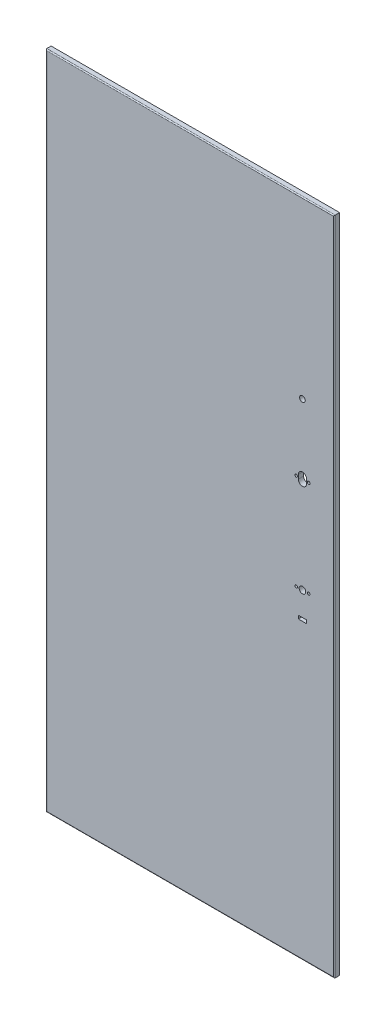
ISO-10303-21;
HEADER;
FILE_DESCRIPTION(('STEP AP214'),'2;1');
FILE_NAME('part.step','',(''),(''),'','','');
FILE_SCHEMA(('AUTOMOTIVE_DESIGN { 1 0 10303 214 1 1 1 1 }'));
ENDSEC;
DATA;
#1=APPLICATION_CONTEXT('core data for automotive mechanical design processes');
#2=APPLICATION_PROTOCOL_DEFINITION('international standard','automotive_design',2000,#1);
#3=PRODUCT_CONTEXT('',#1,'mechanical');
#4=PRODUCT('Part','Part','',(#3));
#5=PRODUCT_RELATED_PRODUCT_CATEGORY('part','',(#4));
#6=PRODUCT_DEFINITION_FORMATION('','',#4);
#7=PRODUCT_DEFINITION_CONTEXT('part definition',#1,'design');
#8=PRODUCT_DEFINITION('design','',#6,#7);
#9=PRODUCT_DEFINITION_SHAPE('','',#8);
#10=(LENGTH_UNIT() NAMED_UNIT(*) SI_UNIT(.MILLI.,.METRE.));
#11=(NAMED_UNIT(*) PLANE_ANGLE_UNIT() SI_UNIT($,.RADIAN.));
#12=(NAMED_UNIT(*) SI_UNIT($,.STERADIAN.) SOLID_ANGLE_UNIT());
#13=UNCERTAINTY_MEASURE_WITH_UNIT(LENGTH_MEASURE(1.E-05),#10,'distance_accuracy_value','');
#14=(GEOMETRIC_REPRESENTATION_CONTEXT(3) GLOBAL_UNCERTAINTY_ASSIGNED_CONTEXT((#13)) GLOBAL_UNIT_ASSIGNED_CONTEXT((#10,
#11,#12)) REPRESENTATION_CONTEXT('',''));
#15=CARTESIAN_POINT('',(0.,0.,0.));
#16=DIRECTION('',(0.,0.,1.));
#17=DIRECTION('',(1.,0.,0.));
#18=AXIS2_PLACEMENT_3D('',#15,#16,#17);
#19=CARTESIAN_POINT('',(-436.,-998.499999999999,16.));
#20=DIRECTION('',(1.,0.,0.));
#21=DIRECTION('',(0.,0.,-1.));
#22=AXIS2_PLACEMENT_3D('',#19,#20,#21);
#23=PLANE('',#22);
#24=DIRECTION('',(0.,0.,-1.));
#25=VECTOR('',#24,1.);
#26=CARTESIAN_POINT('',(-436.,-998.499999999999,16.));
#27=LINE('',#26,#25);
#28=CARTESIAN_POINT('',(-436.,-998.499999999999,13.));
#29=VERTEX_POINT('',#28);
#30=CARTESIAN_POINT('',(-436.,-998.499999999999,0.));
#31=VERTEX_POINT('',#30);
#32=EDGE_CURVE('E270',#29,#31,#27,.T.);
#33=ORIENTED_EDGE('',*,*,#32,.F.);
#34=DIRECTION('',(0.,-1.,0.));
#35=VECTOR('',#34,1.);
#36=CARTESIAN_POINT('',(-436.,-998.499999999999,13.));
#37=LINE('',#36,#35);
#38=CARTESIAN_POINT('',(-436.,998.5,13.));
#39=VERTEX_POINT('',#38);
#40=EDGE_CURVE('E11',#29,#39,#37,.F.);
#41=ORIENTED_EDGE('',*,*,#40,.T.);
#42=DIRECTION('',(0.,0.,-1.));
#43=VECTOR('',#42,1.);
#44=CARTESIAN_POINT('',(-436.,998.5,16.));
#45=LINE('',#44,#43);
#46=CARTESIAN_POINT('',(-436.,998.5,0.));
#47=VERTEX_POINT('',#46);
#48=EDGE_CURVE('E264',#39,#47,#45,.T.);
#49=ORIENTED_EDGE('',*,*,#48,.T.);
#50=DIRECTION('',(0.,-1.,0.));
#51=VECTOR('',#50,1.);
#52=CARTESIAN_POINT('',(-436.,-998.499999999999,0.));
#53=LINE('',#52,#51);
#54=EDGE_CURVE('E161',#47,#31,#53,.T.);
#55=ORIENTED_EDGE('',*,*,#54,.T.);
#56=EDGE_LOOP('',(#33,#41,#49,#55));
#57=FACE_BOUND('',#56,.T.);
#58=ADVANCED_FACE('F41',(#57),#23,.F.);
#59=CARTESIAN_POINT('',(-436.,-998.499999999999,16.));
#60=DIRECTION('',(0.,1.,0.));
#61=DIRECTION('',(0.,0.,1.));
#62=AXIS2_PLACEMENT_3D('',#59,#60,#61);
#63=PLANE('',#62);
#64=DIRECTION('',(0.,0.,-1.));
#65=VECTOR('',#64,1.);
#66=CARTESIAN_POINT('',(436.,-998.499999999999,16.));
#67=LINE('',#66,#65);
#68=CARTESIAN_POINT('',(436.,-998.499999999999,13.));
#69=VERTEX_POINT('',#68);
#70=CARTESIAN_POINT('',(436.,-998.499999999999,0.));
#71=VERTEX_POINT('',#70);
#72=EDGE_CURVE('E268',#69,#71,#67,.T.);
#73=ORIENTED_EDGE('',*,*,#72,.F.);
#74=DIRECTION('',(1.,0.,0.));
#75=VECTOR('',#74,1.);
#76=CARTESIAN_POINT('',(-436.,-998.499999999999,13.));
#77=LINE('',#76,#75);
#78=EDGE_CURVE('E281',#69,#29,#77,.F.);
#79=ORIENTED_EDGE('',*,*,#78,.T.);
#80=ORIENTED_EDGE('',*,*,#32,.T.);
#81=DIRECTION('',(1.,0.,0.));
#82=VECTOR('',#81,1.);
#83=CARTESIAN_POINT('',(-436.,-998.499999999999,0.));
#84=LINE('',#83,#82);
#85=EDGE_CURVE('E255',#31,#71,#84,.T.);
#86=ORIENTED_EDGE('',*,*,#85,.T.);
#87=EDGE_LOOP('',(#73,#79,#80,#86));
#88=FACE_BOUND('',#87,.T.);
#89=ADVANCED_FACE('F311',(#88),#63,.F.);
#90=CARTESIAN_POINT('',(436.,-998.499999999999,16.));
#91=DIRECTION('',(-1.,0.,0.));
#92=DIRECTION('',(0.,0.,1.));
#93=AXIS2_PLACEMENT_3D('',#90,#91,#92);
#94=PLANE('',#93);
#95=DIRECTION('',(0.,0.,-1.));
#96=VECTOR('',#95,1.);
#97=CARTESIAN_POINT('',(436.,998.5,16.));
#98=LINE('',#97,#96);
#99=CARTESIAN_POINT('',(436.,998.5,13.));
#100=VERTEX_POINT('',#99);
#101=CARTESIAN_POINT('',(436.,998.5,0.));
#102=VERTEX_POINT('',#101);
#103=EDGE_CURVE('E266',#100,#102,#98,.T.);
#104=ORIENTED_EDGE('',*,*,#103,.F.);
#105=DIRECTION('',(0.,1.,0.));
#106=VECTOR('',#105,1.);
#107=CARTESIAN_POINT('',(436.,-998.499999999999,13.));
#108=LINE('',#107,#106);
#109=EDGE_CURVE('E284',#100,#69,#108,.F.);
#110=ORIENTED_EDGE('',*,*,#109,.T.);
#111=ORIENTED_EDGE('',*,*,#72,.T.);
#112=DIRECTION('',(0.,1.,0.));
#113=VECTOR('',#112,1.);
#114=CARTESIAN_POINT('',(436.,-998.499999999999,0.));
#115=LINE('',#114,#113);
#116=EDGE_CURVE('E258',#71,#102,#115,.T.);
#117=ORIENTED_EDGE('',*,*,#116,.T.);
#118=EDGE_LOOP('',(#104,#110,#111,#117));
#119=FACE_BOUND('',#118,.T.);
#120=ADVANCED_FACE('F308',(#119),#94,.F.);
#121=CARTESIAN_POINT('',(-436.,998.5,16.));
#122=DIRECTION('',(0.,-1.,0.));
#123=DIRECTION('',(0.,0.,-1.));
#124=AXIS2_PLACEMENT_3D('',#121,#122,#123);
#125=PLANE('',#124);
#126=ORIENTED_EDGE('',*,*,#48,.F.);
#127=DIRECTION('',(-1.,0.,0.));
#128=VECTOR('',#127,1.);
#129=CARTESIAN_POINT('',(-436.,998.5,13.));
#130=LINE('',#129,#128);
#131=EDGE_CURVE('E50',#39,#100,#130,.F.);
#132=ORIENTED_EDGE('',*,*,#131,.T.);
#133=ORIENTED_EDGE('',*,*,#103,.T.);
#134=DIRECTION('',(-1.,0.,0.));
#135=VECTOR('',#134,1.);
#136=CARTESIAN_POINT('',(-436.,998.5,0.));
#137=LINE('',#136,#135);
#138=EDGE_CURVE('E261',#102,#47,#137,.T.);
#139=ORIENTED_EDGE('',*,*,#138,.T.);
#140=EDGE_LOOP('',(#126,#132,#133,#139));
#141=FACE_BOUND('',#140,.T.);
#142=ADVANCED_FACE('F320',(#141),#125,.F.);
#143=CARTESIAN_POINT('',(0.,0.,16.));
#144=DIRECTION('',(0.,0.,-1.));
#145=DIRECTION('',(-1.,0.,0.));
#146=AXIS2_PLACEMENT_3D('',#143,#144,#145);
#147=PLANE('',#146);
#148=DIRECTION('',(0.,-1.,0.));
#149=VECTOR('',#148,1.);
#150=CARTESIAN_POINT('',(-433.,0.,16.));
#151=LINE('',#150,#149);
#152=CARTESIAN_POINT('',(-433.,995.5,16.));
#153=VERTEX_POINT('',#152);
#154=CARTESIAN_POINT('',(-433.,-995.499999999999,16.));
#155=VERTEX_POINT('',#154);
#156=EDGE_CURVE('E272',#153,#155,#151,.T.);
#157=ORIENTED_EDGE('',*,*,#156,.T.);
#158=DIRECTION('',(1.,0.,0.));
#159=VECTOR('',#158,1.);
#160=CARTESIAN_POINT('',(0.,-995.499999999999,16.));
#161=LINE('',#160,#159);
#162=CARTESIAN_POINT('',(433.,-995.499999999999,16.));
#163=VERTEX_POINT('',#162);
#164=EDGE_CURVE('E278',#155,#163,#161,.T.);
#165=ORIENTED_EDGE('',*,*,#164,.T.);
#166=DIRECTION('',(0.,1.,0.));
#167=VECTOR('',#166,1.);
#168=CARTESIAN_POINT('',(433.,0.,16.));
#169=LINE('',#168,#167);
#170=CARTESIAN_POINT('',(433.,995.5,16.));
#171=VERTEX_POINT('',#170);
#172=EDGE_CURVE('E276',#163,#171,#169,.T.);
#173=ORIENTED_EDGE('',*,*,#172,.T.);
#174=DIRECTION('',(-1.,0.,0.));
#175=VECTOR('',#174,1.);
#176=CARTESIAN_POINT('',(0.,995.5,16.));
#177=LINE('',#176,#175);
#178=EDGE_CURVE('E274',#171,#153,#177,.T.);
#179=ORIENTED_EDGE('',*,*,#178,.T.);
#180=EDGE_LOOP('',(#157,#165,#173,#179));
#181=FACE_BOUND('',#180,.T.);
#182=DIRECTION('',(0.,-1.,0.));
#183=VECTOR('',#182,1.);
#184=CARTESIAN_POINT('',(327.199999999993,-101.800000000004,16.));
#185=LINE('',#184,#183);
#186=CARTESIAN_POINT('',(327.199999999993,-101.800000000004,16.));
#187=VERTEX_POINT('',#186);
#188=CARTESIAN_POINT('',(327.199999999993,-111.800000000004,16.));
#189=VERTEX_POINT('',#188);
#190=EDGE_CURVE('E143',#187,#189,#185,.T.);
#191=ORIENTED_EDGE('',*,*,#190,.F.);
#192=DIRECTION('',(-1.,0.,0.));
#193=VECTOR('',#192,1.);
#194=CARTESIAN_POINT('',(352.199999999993,-101.800000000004,16.));
#195=LINE('',#194,#193);
#196=CARTESIAN_POINT('',(352.199999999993,-101.800000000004,16.));
#197=VERTEX_POINT('',#196);
#198=EDGE_CURVE('E170',#197,#187,#195,.T.);
#199=ORIENTED_EDGE('',*,*,#198,.F.);
#200=DIRECTION('',(0.,1.,0.));
#201=VECTOR('',#200,1.);
#202=CARTESIAN_POINT('',(352.199999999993,-111.800000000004,16.));
#203=LINE('',#202,#201);
#204=CARTESIAN_POINT('',(352.199999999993,-111.800000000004,16.));
#205=VERTEX_POINT('',#204);
#206=EDGE_CURVE('E168',#205,#197,#203,.T.);
#207=ORIENTED_EDGE('',*,*,#206,.F.);
#208=DIRECTION('',(1.,0.,0.));
#209=VECTOR('',#208,1.);
#210=CARTESIAN_POINT('',(327.199999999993,-111.800000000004,16.));
#211=LINE('',#210,#209);
#212=EDGE_CURVE('E153',#189,#205,#211,.T.);
#213=ORIENTED_EDGE('',*,*,#212,.F.);
#214=EDGE_LOOP('',(#191,#199,#207,#213));
#215=FACE_BOUND('',#214,.T.);
#216=CARTESIAN_POINT('',(320.699999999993,260.399999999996,16.));
#217=DIRECTION('',(0.,0.,1.));
#218=DIRECTION('',(1.,0.,0.));
#219=AXIS2_PLACEMENT_3D('',#216,#217,#218);
#220=CIRCLE('',#219,4.09999999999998);
#221=CARTESIAN_POINT('',(324.799999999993,260.399999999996,16.));
#222=VERTEX_POINT('',#221);
#223=EDGE_CURVE('E200',#222,#222,#220,.T.);
#224=ORIENTED_EDGE('',*,*,#223,.F.);
#225=EDGE_LOOP('',(#224));
#226=FACE_BOUND('',#225,.T.);
#227=CARTESIAN_POINT('',(358.699999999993,260.399999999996,16.));
#228=DIRECTION('',(0.,0.,1.));
#229=DIRECTION('',(1.,0.,0.));
#230=AXIS2_PLACEMENT_3D('',#227,#228,#229);
#231=CIRCLE('',#230,4.09999999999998);
#232=CARTESIAN_POINT('',(362.799999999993,260.399999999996,16.));
#233=VERTEX_POINT('',#232);
#234=EDGE_CURVE('E194',#233,#233,#231,.T.);
#235=ORIENTED_EDGE('',*,*,#234,.F.);
#236=EDGE_LOOP('',(#235));
#237=FACE_BOUND('',#236,.T.);
#238=CARTESIAN_POINT('',(339.699999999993,470.200000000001,16.));
#239=DIRECTION('',(0.,0.,1.));
#240=DIRECTION('',(1.,0.,0.));
#241=AXIS2_PLACEMENT_3D('',#238,#239,#240);
#242=CIRCLE('',#241,8.50000000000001);
#243=CARTESIAN_POINT('',(348.199999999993,470.200000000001,16.));
#244=VERTEX_POINT('',#243);
#245=EDGE_CURVE('E187',#244,#244,#242,.T.);
#246=ORIENTED_EDGE('',*,*,#245,.F.);
#247=EDGE_LOOP('',(#246));
#248=FACE_BOUND('',#247,.T.);
#249=CARTESIAN_POINT('',(339.699999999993,-29.8000000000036,16.));
#250=DIRECTION('',(0.,0.,1.));
#251=DIRECTION('',(1.,0.,0.));
#252=AXIS2_PLACEMENT_3D('',#249,#250,#251);
#253=CIRCLE('',#252,9.99999999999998);
#254=CARTESIAN_POINT('',(349.699999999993,-29.8000000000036,16.));
#255=VERTEX_POINT('',#254);
#256=EDGE_CURVE('E176',#255,#255,#253,.T.);
#257=ORIENTED_EDGE('',*,*,#256,.F.);
#258=EDGE_LOOP('',(#257));
#259=FACE_BOUND('',#258,.T.);
#260=CARTESIAN_POINT('',(339.699999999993,266.649999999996,16.));
#261=DIRECTION('',(0.,0.,1.));
#262=DIRECTION('',(1.,0.,0.));
#263=AXIS2_PLACEMENT_3D('',#260,#261,#262);
#264=CIRCLE('',#263,12.5);
#265=CARTESIAN_POINT('',(352.199999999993,266.649999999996,16.));
#266=VERTEX_POINT('',#265);
#267=CARTESIAN_POINT('',(327.199999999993,266.649999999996,16.));
#268=VERTEX_POINT('',#267);
#269=EDGE_CURVE('E224',#266,#268,#264,.T.);
#270=ORIENTED_EDGE('',*,*,#269,.F.);
#271=DIRECTION('',(0.,1.,0.));
#272=VECTOR('',#271,1.);
#273=CARTESIAN_POINT('',(352.199999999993,254.149999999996,16.));
#274=LINE('',#273,#272);
#275=CARTESIAN_POINT('',(352.199999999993,254.149999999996,16.));
#276=VERTEX_POINT('',#275);
#277=EDGE_CURVE('E232',#276,#266,#274,.T.);
#278=ORIENTED_EDGE('',*,*,#277,.F.);
#279=CARTESIAN_POINT('',(339.699999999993,254.149999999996,16.));
#280=DIRECTION('',(0.,0.,1.));
#281=DIRECTION('',(1.,0.,0.));
#282=AXIS2_PLACEMENT_3D('',#279,#280,#281);
#283=CIRCLE('',#282,12.5);
#284=CARTESIAN_POINT('',(327.199999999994,254.149999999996,16.));
#285=VERTEX_POINT('',#284);
#286=EDGE_CURVE('E229',#285,#276,#283,.T.);
#287=ORIENTED_EDGE('',*,*,#286,.F.);
#288=DIRECTION('',(0.,-1.,0.));
#289=VECTOR('',#288,1.);
#290=CARTESIAN_POINT('',(327.199999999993,266.649999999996,16.));
#291=LINE('',#290,#289);
#292=EDGE_CURVE('E226',#268,#285,#291,.T.);
#293=ORIENTED_EDGE('',*,*,#292,.F.);
#294=EDGE_LOOP('',(#270,#278,#287,#293));
#295=FACE_BOUND('',#294,.T.);
#296=CARTESIAN_POINT('',(358.699999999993,-29.8000000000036,16.));
#297=DIRECTION('',(0.,0.,1.));
#298=DIRECTION('',(1.,0.,0.));
#299=AXIS2_PLACEMENT_3D('',#296,#297,#298);
#300=CIRCLE('',#299,3.99999999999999);
#301=CARTESIAN_POINT('',(362.699999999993,-29.8000000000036,16.));
#302=VERTEX_POINT('',#301);
#303=EDGE_CURVE('E206',#302,#302,#300,.T.);
#304=ORIENTED_EDGE('',*,*,#303,.F.);
#305=EDGE_LOOP('',(#304));
#306=FACE_BOUND('',#305,.T.);
#307=CARTESIAN_POINT('',(320.699999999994,-29.8000000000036,16.));
#308=DIRECTION('',(0.,0.,1.));
#309=DIRECTION('',(1.,0.,0.));
#310=AXIS2_PLACEMENT_3D('',#307,#308,#309);
#311=CIRCLE('',#310,3.99999999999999);
#312=CARTESIAN_POINT('',(324.699999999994,-29.8000000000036,16.));
#313=VERTEX_POINT('',#312);
#314=EDGE_CURVE('E213',#313,#313,#311,.T.);
#315=ORIENTED_EDGE('',*,*,#314,.F.);
#316=EDGE_LOOP('',(#315));
#317=FACE_BOUND('',#316,.T.);
#318=ADVANCED_FACE('F165',(#181,#215,#226,#237,#248,#259,#295,#306,#317),#147,.F.);
#319=CARTESIAN_POINT('',(0.,0.,0.));
#320=DIRECTION('',(0.,0.,-1.));
#321=DIRECTION('',(-1.,0.,0.));
#322=AXIS2_PLACEMENT_3D('',#319,#320,#321);
#323=PLANE('',#322);
#324=DIRECTION('',(-1.,0.,0.));
#325=VECTOR('',#324,1.);
#326=CARTESIAN_POINT('',(352.199999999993,-101.800000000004,0.));
#327=LINE('',#326,#325);
#328=CARTESIAN_POINT('',(352.199999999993,-101.800000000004,0.));
#329=VERTEX_POINT('',#328);
#330=CARTESIAN_POINT('',(327.199999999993,-101.800000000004,0.));
#331=VERTEX_POINT('',#330);
#332=EDGE_CURVE('E154',#329,#331,#327,.T.);
#333=ORIENTED_EDGE('',*,*,#332,.T.);
#334=DIRECTION('',(0.,-1.,0.));
#335=VECTOR('',#334,1.);
#336=CARTESIAN_POINT('',(327.199999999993,-101.800000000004,0.));
#337=LINE('',#336,#335);
#338=CARTESIAN_POINT('',(327.199999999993,-111.800000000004,0.));
#339=VERTEX_POINT('',#338);
#340=EDGE_CURVE('E174',#331,#339,#337,.T.);
#341=ORIENTED_EDGE('',*,*,#340,.T.);
#342=DIRECTION('',(1.,0.,0.));
#343=VECTOR('',#342,1.);
#344=CARTESIAN_POINT('',(327.199999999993,-111.800000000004,0.));
#345=LINE('',#344,#343);
#346=CARTESIAN_POINT('',(352.199999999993,-111.800000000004,0.));
#347=VERTEX_POINT('',#346);
#348=EDGE_CURVE('E160',#339,#347,#345,.T.);
#349=ORIENTED_EDGE('',*,*,#348,.T.);
#350=DIRECTION('',(0.,1.,0.));
#351=VECTOR('',#350,1.);
#352=CARTESIAN_POINT('',(352.199999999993,-111.800000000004,0.));
#353=LINE('',#352,#351);
#354=EDGE_CURVE('E178',#347,#329,#353,.T.);
#355=ORIENTED_EDGE('',*,*,#354,.T.);
#356=EDGE_LOOP('',(#333,#341,#349,#355));
#357=FACE_BOUND('',#356,.T.);
#358=CARTESIAN_POINT('',(320.699999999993,260.399999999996,0.));
#359=DIRECTION('',(0.,0.,1.));
#360=DIRECTION('',(1.,0.,0.));
#361=AXIS2_PLACEMENT_3D('',#358,#359,#360);
#362=CIRCLE('',#361,4.09999999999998);
#363=CARTESIAN_POINT('',(324.799999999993,260.399999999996,0.));
#364=VERTEX_POINT('',#363);
#365=EDGE_CURVE('E203',#364,#364,#362,.T.);
#366=ORIENTED_EDGE('',*,*,#365,.T.);
#367=EDGE_LOOP('',(#366));
#368=FACE_BOUND('',#367,.T.);
#369=CARTESIAN_POINT('',(358.699999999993,260.399999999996,0.));
#370=DIRECTION('',(0.,0.,1.));
#371=DIRECTION('',(1.,0.,0.));
#372=AXIS2_PLACEMENT_3D('',#369,#370,#371);
#373=CIRCLE('',#372,4.09999999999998);
#374=CARTESIAN_POINT('',(362.799999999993,260.399999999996,0.));
#375=VERTEX_POINT('',#374);
#376=EDGE_CURVE('E197',#375,#375,#373,.T.);
#377=ORIENTED_EDGE('',*,*,#376,.T.);
#378=EDGE_LOOP('',(#377));
#379=FACE_BOUND('',#378,.T.);
#380=CARTESIAN_POINT('',(339.699999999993,470.200000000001,0.));
#381=DIRECTION('',(0.,0.,1.));
#382=DIRECTION('',(1.,0.,0.));
#383=AXIS2_PLACEMENT_3D('',#380,#381,#382);
#384=CIRCLE('',#383,8.50000000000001);
#385=CARTESIAN_POINT('',(348.199999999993,470.200000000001,0.));
#386=VERTEX_POINT('',#385);
#387=EDGE_CURVE('E191',#386,#386,#384,.T.);
#388=ORIENTED_EDGE('',*,*,#387,.T.);
#389=EDGE_LOOP('',(#388));
#390=FACE_BOUND('',#389,.T.);
#391=CARTESIAN_POINT('',(339.699999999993,-29.8000000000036,0.));
#392=DIRECTION('',(0.,0.,1.));
#393=DIRECTION('',(1.,0.,0.));
#394=AXIS2_PLACEMENT_3D('',#391,#392,#393);
#395=CIRCLE('',#394,9.99999999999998);
#396=CARTESIAN_POINT('',(349.699999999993,-29.8000000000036,0.));
#397=VERTEX_POINT('',#396);
#398=EDGE_CURVE('E220',#397,#397,#395,.T.);
#399=ORIENTED_EDGE('',*,*,#398,.T.);
#400=EDGE_LOOP('',(#399));
#401=FACE_BOUND('',#400,.T.);
#402=DIRECTION('',(0.,1.,0.));
#403=VECTOR('',#402,1.);
#404=CARTESIAN_POINT('',(352.199999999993,254.149999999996,0.));
#405=LINE('',#404,#403);
#406=CARTESIAN_POINT('',(352.199999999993,254.149999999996,0.));
#407=VERTEX_POINT('',#406);
#408=CARTESIAN_POINT('',(352.199999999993,266.649999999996,0.));
#409=VERTEX_POINT('',#408);
#410=EDGE_CURVE('E227',#407,#409,#405,.T.);
#411=ORIENTED_EDGE('',*,*,#410,.T.);
#412=CARTESIAN_POINT('',(339.699999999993,266.649999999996,0.));
#413=DIRECTION('',(0.,0.,1.));
#414=DIRECTION('',(1.,0.,0.));
#415=AXIS2_PLACEMENT_3D('',#412,#413,#414);
#416=CIRCLE('',#415,12.5);
#417=CARTESIAN_POINT('',(327.199999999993,266.649999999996,0.));
#418=VERTEX_POINT('',#417);
#419=EDGE_CURVE('E209',#409,#418,#416,.T.);
#420=ORIENTED_EDGE('',*,*,#419,.T.);
#421=DIRECTION('',(0.,-1.,0.));
#422=VECTOR('',#421,1.);
#423=CARTESIAN_POINT('',(327.199999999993,266.649999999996,0.));
#424=LINE('',#423,#422);
#425=CARTESIAN_POINT('',(327.199999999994,254.149999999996,0.));
#426=VERTEX_POINT('',#425);
#427=EDGE_CURVE('E237',#418,#426,#424,.T.);
#428=ORIENTED_EDGE('',*,*,#427,.T.);
#429=CARTESIAN_POINT('',(339.699999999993,254.149999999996,0.));
#430=DIRECTION('',(0.,0.,1.));
#431=DIRECTION('',(1.,0.,0.));
#432=AXIS2_PLACEMENT_3D('',#429,#430,#431);
#433=CIRCLE('',#432,12.5);
#434=EDGE_CURVE('E240',#426,#407,#433,.T.);
#435=ORIENTED_EDGE('',*,*,#434,.T.);
#436=EDGE_LOOP('',(#411,#420,#428,#435));
#437=FACE_BOUND('',#436,.T.);
#438=CARTESIAN_POINT('',(358.699999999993,-29.8000000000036,0.));
#439=DIRECTION('',(0.,0.,1.));
#440=DIRECTION('',(1.,0.,0.));
#441=AXIS2_PLACEMENT_3D('',#438,#439,#440);
#442=CIRCLE('',#441,3.99999999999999);
#443=CARTESIAN_POINT('',(362.699999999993,-29.8000000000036,0.));
#444=VERTEX_POINT('',#443);
#445=EDGE_CURVE('E210',#444,#444,#442,.T.);
#446=ORIENTED_EDGE('',*,*,#445,.T.);
#447=EDGE_LOOP('',(#446));
#448=FACE_BOUND('',#447,.T.);
#449=CARTESIAN_POINT('',(320.699999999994,-29.8000000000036,0.));
#450=DIRECTION('',(0.,0.,1.));
#451=DIRECTION('',(1.,0.,0.));
#452=AXIS2_PLACEMENT_3D('',#449,#450,#451);
#453=CIRCLE('',#452,3.99999999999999);
#454=CARTESIAN_POINT('',(324.699999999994,-29.8000000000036,0.));
#455=VERTEX_POINT('',#454);
#456=EDGE_CURVE('E190',#455,#455,#453,.T.);
#457=ORIENTED_EDGE('',*,*,#456,.T.);
#458=EDGE_LOOP('',(#457));
#459=FACE_BOUND('',#458,.T.);
#460=ORIENTED_EDGE('',*,*,#54,.F.);
#461=ORIENTED_EDGE('',*,*,#138,.F.);
#462=ORIENTED_EDGE('',*,*,#116,.F.);
#463=ORIENTED_EDGE('',*,*,#85,.F.);
#464=EDGE_LOOP('',(#460,#461,#462,#463));
#465=FACE_BOUND('',#464,.T.);
#466=ADVANCED_FACE('F319',(#357,#368,#379,#390,#401,#437,#448,#459,#465),#323,.T.);
#467=CARTESIAN_POINT('',(320.699999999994,-29.8000000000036,16.));
#468=DIRECTION('',(0.,0.,-1.));
#469=DIRECTION('',(-1.,0.,0.));
#470=AXIS2_PLACEMENT_3D('',#467,#468,#469);
#471=CYLINDRICAL_SURFACE('',#470,3.99999999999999);
#472=ORIENTED_EDGE('',*,*,#314,.T.);
#473=EDGE_LOOP('',(#472));
#474=FACE_BOUND('',#473,.T.);
#475=ORIENTED_EDGE('',*,*,#456,.F.);
#476=EDGE_LOOP('',(#475));
#477=FACE_BOUND('',#476,.T.);
#478=ADVANCED_FACE('F326',(#474,#477),#471,.F.);
#479=CARTESIAN_POINT('',(358.699999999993,-29.8000000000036,16.));
#480=DIRECTION('',(0.,0.,-1.));
#481=DIRECTION('',(-1.,0.,0.));
#482=AXIS2_PLACEMENT_3D('',#479,#480,#481);
#483=CYLINDRICAL_SURFACE('',#482,3.99999999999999);
#484=ORIENTED_EDGE('',*,*,#303,.T.);
#485=EDGE_LOOP('',(#484));
#486=FACE_BOUND('',#485,.T.);
#487=ORIENTED_EDGE('',*,*,#445,.F.);
#488=EDGE_LOOP('',(#487));
#489=FACE_BOUND('',#488,.T.);
#490=ADVANCED_FACE('F377',(#486,#489),#483,.F.);
#491=CARTESIAN_POINT('',(339.699999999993,266.649999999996,16.));
#492=DIRECTION('',(0.,0.,-1.));
#493=DIRECTION('',(-1.,0.,0.));
#494=AXIS2_PLACEMENT_3D('',#491,#492,#493);
#495=CYLINDRICAL_SURFACE('',#494,12.5);
#496=ORIENTED_EDGE('',*,*,#419,.F.);
#497=DIRECTION('',(0.,0.,-1.));
#498=VECTOR('',#497,1.);
#499=CARTESIAN_POINT('',(352.199999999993,266.649999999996,16.));
#500=LINE('',#499,#498);
#501=EDGE_CURVE('E234',#266,#409,#500,.T.);
#502=ORIENTED_EDGE('',*,*,#501,.F.);
#503=ORIENTED_EDGE('',*,*,#269,.T.);
#504=DIRECTION('',(0.,0.,-1.));
#505=VECTOR('',#504,1.);
#506=CARTESIAN_POINT('',(327.199999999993,266.649999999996,16.));
#507=LINE('',#506,#505);
#508=EDGE_CURVE('E223',#268,#418,#507,.T.);
#509=ORIENTED_EDGE('',*,*,#508,.T.);
#510=EDGE_LOOP('',(#496,#502,#503,#509));
#511=FACE_BOUND('',#510,.T.);
#512=ADVANCED_FACE('F380',(#511),#495,.F.);
#513=CARTESIAN_POINT('',(327.199999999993,266.649999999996,16.));
#514=DIRECTION('',(1.,0.,0.));
#515=DIRECTION('',(0.,1.,0.));
#516=AXIS2_PLACEMENT_3D('',#513,#514,#515);
#517=PLANE('',#516);
#518=ORIENTED_EDGE('',*,*,#427,.F.);
#519=ORIENTED_EDGE('',*,*,#508,.F.);
#520=ORIENTED_EDGE('',*,*,#292,.T.);
#521=DIRECTION('',(0.,0.,-1.));
#522=VECTOR('',#521,1.);
#523=CARTESIAN_POINT('',(327.199999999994,254.149999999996,16.));
#524=LINE('',#523,#522);
#525=EDGE_CURVE('E249',#285,#426,#524,.T.);
#526=ORIENTED_EDGE('',*,*,#525,.T.);
#527=EDGE_LOOP('',(#518,#519,#520,#526));
#528=FACE_BOUND('',#527,.T.);
#529=ADVANCED_FACE('F395',(#528),#517,.T.);
#530=CARTESIAN_POINT('',(339.699999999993,254.149999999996,16.));
#531=DIRECTION('',(0.,0.,-1.));
#532=DIRECTION('',(-1.,0.,0.));
#533=AXIS2_PLACEMENT_3D('',#530,#531,#532);
#534=CYLINDRICAL_SURFACE('',#533,12.5);
#535=ORIENTED_EDGE('',*,*,#434,.F.);
#536=ORIENTED_EDGE('',*,*,#525,.F.);
#537=ORIENTED_EDGE('',*,*,#286,.T.);
#538=DIRECTION('',(0.,0.,-1.));
#539=VECTOR('',#538,1.);
#540=CARTESIAN_POINT('',(352.199999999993,254.149999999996,16.));
#541=LINE('',#540,#539);
#542=EDGE_CURVE('E247',#276,#407,#541,.T.);
#543=ORIENTED_EDGE('',*,*,#542,.T.);
#544=EDGE_LOOP('',(#535,#536,#537,#543));
#545=FACE_BOUND('',#544,.T.);
#546=ADVANCED_FACE('F391',(#545),#534,.F.);
#547=CARTESIAN_POINT('',(352.199999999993,254.149999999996,16.));
#548=DIRECTION('',(-1.,0.,0.));
#549=DIRECTION('',(0.,0.,1.));
#550=AXIS2_PLACEMENT_3D('',#547,#548,#549);
#551=PLANE('',#550);
#552=ORIENTED_EDGE('',*,*,#410,.F.);
#553=ORIENTED_EDGE('',*,*,#542,.F.);
#554=ORIENTED_EDGE('',*,*,#277,.T.);
#555=ORIENTED_EDGE('',*,*,#501,.T.);
#556=EDGE_LOOP('',(#552,#553,#554,#555));
#557=FACE_BOUND('',#556,.T.);
#558=ADVANCED_FACE('F387',(#557),#551,.T.);
#559=CARTESIAN_POINT('',(339.699999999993,-29.8000000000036,16.));
#560=DIRECTION('',(0.,0.,-1.));
#561=DIRECTION('',(-1.,0.,0.));
#562=AXIS2_PLACEMENT_3D('',#559,#560,#561);
#563=CYLINDRICAL_SURFACE('',#562,9.99999999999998);
#564=ORIENTED_EDGE('',*,*,#256,.T.);
#565=EDGE_LOOP('',(#564));
#566=FACE_BOUND('',#565,.T.);
#567=ORIENTED_EDGE('',*,*,#398,.F.);
#568=EDGE_LOOP('',(#567));
#569=FACE_BOUND('',#568,.T.);
#570=ADVANCED_FACE('F369',(#566,#569),#563,.F.);
#571=CARTESIAN_POINT('',(339.699999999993,470.200000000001,16.));
#572=DIRECTION('',(0.,0.,-1.));
#573=DIRECTION('',(-1.,0.,0.));
#574=AXIS2_PLACEMENT_3D('',#571,#572,#573);
#575=CYLINDRICAL_SURFACE('',#574,8.50000000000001);
#576=ORIENTED_EDGE('',*,*,#245,.T.);
#577=EDGE_LOOP('',(#576));
#578=FACE_BOUND('',#577,.T.);
#579=ORIENTED_EDGE('',*,*,#387,.F.);
#580=EDGE_LOOP('',(#579));
#581=FACE_BOUND('',#580,.T.);
#582=ADVANCED_FACE('F365',(#578,#581),#575,.F.);
#583=CARTESIAN_POINT('',(358.699999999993,260.399999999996,16.));
#584=DIRECTION('',(0.,0.,-1.));
#585=DIRECTION('',(-1.,0.,0.));
#586=AXIS2_PLACEMENT_3D('',#583,#584,#585);
#587=CYLINDRICAL_SURFACE('',#586,4.09999999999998);
#588=ORIENTED_EDGE('',*,*,#234,.T.);
#589=EDGE_LOOP('',(#588));
#590=FACE_BOUND('',#589,.T.);
#591=ORIENTED_EDGE('',*,*,#376,.F.);
#592=EDGE_LOOP('',(#591));
#593=FACE_BOUND('',#592,.T.);
#594=ADVANCED_FACE('F368',(#590,#593),#587,.F.);
#595=CARTESIAN_POINT('',(320.699999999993,260.399999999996,16.));
#596=DIRECTION('',(0.,0.,-1.));
#597=DIRECTION('',(-1.,0.,0.));
#598=AXIS2_PLACEMENT_3D('',#595,#596,#597);
#599=CYLINDRICAL_SURFACE('',#598,4.09999999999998);
#600=ORIENTED_EDGE('',*,*,#223,.T.);
#601=EDGE_LOOP('',(#600));
#602=FACE_BOUND('',#601,.T.);
#603=ORIENTED_EDGE('',*,*,#365,.F.);
#604=EDGE_LOOP('',(#603));
#605=FACE_BOUND('',#604,.T.);
#606=ADVANCED_FACE('F364',(#602,#605),#599,.F.);
#607=CARTESIAN_POINT('',(327.199999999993,-101.800000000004,16.));
#608=DIRECTION('',(1.,0.,0.));
#609=DIRECTION('',(0.,0.,-1.));
#610=AXIS2_PLACEMENT_3D('',#607,#608,#609);
#611=PLANE('',#610);
#612=ORIENTED_EDGE('',*,*,#340,.F.);
#613=DIRECTION('',(0.,0.,-1.));
#614=VECTOR('',#613,1.);
#615=CARTESIAN_POINT('',(327.199999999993,-101.800000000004,16.));
#616=LINE('',#615,#614);
#617=EDGE_CURVE('E149',#187,#331,#616,.T.);
#618=ORIENTED_EDGE('',*,*,#617,.F.);
#619=ORIENTED_EDGE('',*,*,#190,.T.);
#620=DIRECTION('',(0.,0.,-1.));
#621=VECTOR('',#620,1.);
#622=CARTESIAN_POINT('',(327.199999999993,-111.800000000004,16.));
#623=LINE('',#622,#621);
#624=EDGE_CURVE('E146',#189,#339,#623,.T.);
#625=ORIENTED_EDGE('',*,*,#624,.T.);
#626=EDGE_LOOP('',(#612,#618,#619,#625));
#627=FACE_BOUND('',#626,.T.);
#628=ADVANCED_FACE('F145',(#627),#611,.T.);
#629=CARTESIAN_POINT('',(327.199999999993,-111.800000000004,16.));
#630=DIRECTION('',(0.,1.,0.));
#631=DIRECTION('',(0.,0.,1.));
#632=AXIS2_PLACEMENT_3D('',#629,#630,#631);
#633=PLANE('',#632);
#634=ORIENTED_EDGE('',*,*,#348,.F.);
#635=ORIENTED_EDGE('',*,*,#624,.F.);
#636=ORIENTED_EDGE('',*,*,#212,.T.);
#637=DIRECTION('',(0.,0.,-1.));
#638=VECTOR('',#637,1.);
#639=CARTESIAN_POINT('',(352.199999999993,-111.800000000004,16.));
#640=LINE('',#639,#638);
#641=EDGE_CURVE('E162',#205,#347,#640,.T.);
#642=ORIENTED_EDGE('',*,*,#641,.T.);
#643=EDGE_LOOP('',(#634,#635,#636,#642));
#644=FACE_BOUND('',#643,.T.);
#645=ADVANCED_FACE('F157',(#644),#633,.T.);
#646=CARTESIAN_POINT('',(352.199999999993,-111.800000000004,16.));
#647=DIRECTION('',(-1.,0.,0.));
#648=DIRECTION('',(0.,0.,1.));
#649=AXIS2_PLACEMENT_3D('',#646,#647,#648);
#650=PLANE('',#649);
#651=ORIENTED_EDGE('',*,*,#354,.F.);
#652=ORIENTED_EDGE('',*,*,#641,.F.);
#653=ORIENTED_EDGE('',*,*,#206,.T.);
#654=DIRECTION('',(0.,0.,-1.));
#655=VECTOR('',#654,1.);
#656=CARTESIAN_POINT('',(352.199999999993,-101.800000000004,16.));
#657=LINE('',#656,#655);
#658=EDGE_CURVE('E184',#197,#329,#657,.T.);
#659=ORIENTED_EDGE('',*,*,#658,.T.);
#660=EDGE_LOOP('',(#651,#652,#653,#659));
#661=FACE_BOUND('',#660,.T.);
#662=ADVANCED_FACE('F350',(#661),#650,.T.);
#663=CARTESIAN_POINT('',(352.199999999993,-101.800000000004,16.));
#664=DIRECTION('',(0.,-1.,0.));
#665=DIRECTION('',(0.,0.,-1.));
#666=AXIS2_PLACEMENT_3D('',#663,#664,#665);
#667=PLANE('',#666);
#668=ORIENTED_EDGE('',*,*,#332,.F.);
#669=ORIENTED_EDGE('',*,*,#658,.F.);
#670=ORIENTED_EDGE('',*,*,#198,.T.);
#671=ORIENTED_EDGE('',*,*,#617,.T.);
#672=EDGE_LOOP('',(#668,#669,#670,#671));
#673=FACE_BOUND('',#672,.T.);
#674=ADVANCED_FACE('F346',(#673),#667,.T.);
#675=CARTESIAN_POINT('',(0.,995.5,13.));
#676=DIRECTION('',(-1.,0.,0.));
#677=DIRECTION('',(0.,0.,1.));
#678=AXIS2_PLACEMENT_3D('',#675,#676,#677);
#679=CYLINDRICAL_SURFACE('',#678,3.);
#680=CARTESIAN_POINT('',(433.,995.5,13.));
#681=DIRECTION('',(-0.707106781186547,0.707106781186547,0.));
#682=DIRECTION('',(-0.707106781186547,-0.707106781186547,0.));
#683=AXIS2_PLACEMENT_3D('',#680,#681,#682);
#684=ELLIPSE('',#683,4.24264068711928,3.);
#685=EDGE_CURVE('E290',#100,#171,#684,.F.);
#686=ORIENTED_EDGE('',*,*,#685,.F.);
#687=ORIENTED_EDGE('',*,*,#131,.F.);
#688=CARTESIAN_POINT('',(-433.,995.5,13.));
#689=DIRECTION('',(-0.707106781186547,-0.707106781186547,0.));
#690=DIRECTION('',(0.707106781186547,-0.707106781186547,0.));
#691=AXIS2_PLACEMENT_3D('',#688,#689,#690);
#692=ELLIPSE('',#691,4.24264068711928,3.);
#693=EDGE_CURVE('E45',#153,#39,#692,.T.);
#694=ORIENTED_EDGE('',*,*,#693,.F.);
#695=ORIENTED_EDGE('',*,*,#178,.F.);
#696=EDGE_LOOP('',(#686,#687,#694,#695));
#697=FACE_BOUND('',#696,.T.);
#698=ADVANCED_FACE('F43',(#697),#679,.T.);
#699=CARTESIAN_POINT('',(-433.,0.,13.));
#700=DIRECTION('',(0.,-1.,0.));
#701=DIRECTION('',(0.,0.,-1.));
#702=AXIS2_PLACEMENT_3D('',#699,#700,#701);
#703=CYLINDRICAL_SURFACE('',#702,3.);
#704=ORIENTED_EDGE('',*,*,#693,.T.);
#705=ORIENTED_EDGE('',*,*,#40,.F.);
#706=CARTESIAN_POINT('',(-433.,-995.499999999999,13.));
#707=DIRECTION('',(0.707106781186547,-0.707106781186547,0.));
#708=DIRECTION('',(-0.707106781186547,-0.707106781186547,0.));
#709=AXIS2_PLACEMENT_3D('',#706,#707,#708);
#710=ELLIPSE('',#709,4.24264068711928,3.);
#711=EDGE_CURVE('E289',#155,#29,#710,.T.);
#712=ORIENTED_EDGE('',*,*,#711,.F.);
#713=ORIENTED_EDGE('',*,*,#156,.F.);
#714=EDGE_LOOP('',(#704,#705,#712,#713));
#715=FACE_BOUND('',#714,.T.);
#716=ADVANCED_FACE('F300',(#715),#703,.T.);
#717=CARTESIAN_POINT('',(433.,0.,13.));
#718=DIRECTION('',(0.,1.,0.));
#719=DIRECTION('',(0.,0.,1.));
#720=AXIS2_PLACEMENT_3D('',#717,#718,#719);
#721=CYLINDRICAL_SURFACE('',#720,3.);
#722=ORIENTED_EDGE('',*,*,#685,.T.);
#723=ORIENTED_EDGE('',*,*,#172,.F.);
#724=CARTESIAN_POINT('',(433.,-995.499999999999,13.));
#725=DIRECTION('',(0.707106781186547,0.707106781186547,0.));
#726=DIRECTION('',(-0.707106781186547,0.707106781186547,0.));
#727=AXIS2_PLACEMENT_3D('',#724,#725,#726);
#728=ELLIPSE('',#727,4.24264068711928,3.);
#729=EDGE_CURVE('E287',#69,#163,#728,.F.);
#730=ORIENTED_EDGE('',*,*,#729,.F.);
#731=ORIENTED_EDGE('',*,*,#109,.F.);
#732=EDGE_LOOP('',(#722,#723,#730,#731));
#733=FACE_BOUND('',#732,.T.);
#734=ADVANCED_FACE('F305',(#733),#721,.T.);
#735=CARTESIAN_POINT('',(0.,-995.499999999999,13.));
#736=DIRECTION('',(1.,0.,0.));
#737=DIRECTION('',(0.,0.,-1.));
#738=AXIS2_PLACEMENT_3D('',#735,#736,#737);
#739=CYLINDRICAL_SURFACE('',#738,3.);
#740=ORIENTED_EDGE('',*,*,#711,.T.);
#741=ORIENTED_EDGE('',*,*,#78,.F.);
#742=ORIENTED_EDGE('',*,*,#729,.T.);
#743=ORIENTED_EDGE('',*,*,#164,.F.);
#744=EDGE_LOOP('',(#740,#741,#742,#743));
#745=FACE_BOUND('',#744,.T.);
#746=ADVANCED_FACE('F315',(#745),#739,.T.);
#747=CLOSED_SHELL('',(#58,#89,#120,#142,#318,#466,#478,#490,#512,#529,#546,#558,#570,#582,#594,
#606,#628,#645,#662,#674,#698,#716,#734,#746));
#748=MANIFOLD_SOLID_BREP('B2',#747);
#749=ADVANCED_BREP_SHAPE_REPRESENTATION('',(#18,#748),#14);
#750=SHAPE_DEFINITION_REPRESENTATION(#9,#749);
ENDSEC;
END-ISO-10303-21;
